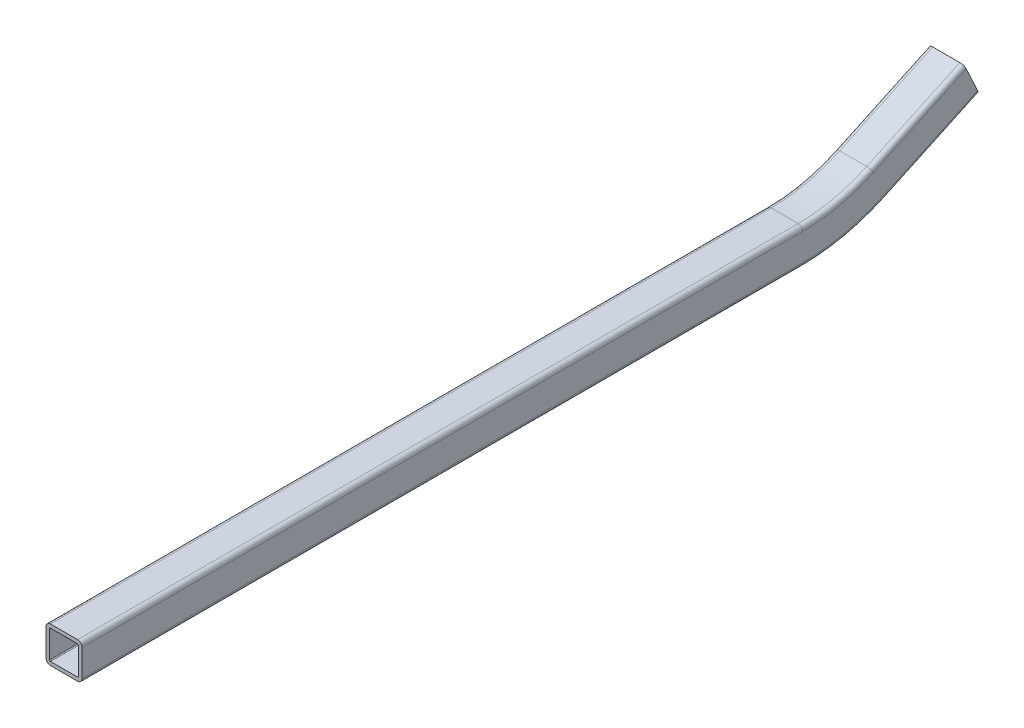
ISO-10303-21;
HEADER;
FILE_DESCRIPTION(('STEP AP214'),'2;1');
FILE_NAME('part.step','',(''),(''),'','','');
FILE_SCHEMA(('AUTOMOTIVE_DESIGN { 1 0 10303 214 1 1 1 1 }'));
ENDSEC;
DATA;
#1=APPLICATION_CONTEXT('core data for automotive mechanical design processes');
#2=APPLICATION_PROTOCOL_DEFINITION('international standard','automotive_design',2000,#1);
#3=PRODUCT_CONTEXT('',#1,'mechanical');
#4=PRODUCT('Part','Part','',(#3));
#5=PRODUCT_RELATED_PRODUCT_CATEGORY('part','',(#4));
#6=PRODUCT_DEFINITION_FORMATION('','',#4);
#7=PRODUCT_DEFINITION_CONTEXT('part definition',#1,'design');
#8=PRODUCT_DEFINITION('design','',#6,#7);
#9=PRODUCT_DEFINITION_SHAPE('','',#8);
#10=(LENGTH_UNIT() NAMED_UNIT(*) SI_UNIT(.MILLI.,.METRE.));
#11=(NAMED_UNIT(*) PLANE_ANGLE_UNIT() SI_UNIT($,.RADIAN.));
#12=(NAMED_UNIT(*) SI_UNIT($,.STERADIAN.) SOLID_ANGLE_UNIT());
#13=UNCERTAINTY_MEASURE_WITH_UNIT(LENGTH_MEASURE(1.E-05),#10,'distance_accuracy_value','');
#14=(GEOMETRIC_REPRESENTATION_CONTEXT(3) GLOBAL_UNCERTAINTY_ASSIGNED_CONTEXT((#13)) GLOBAL_UNIT_ASSIGNED_CONTEXT((#10,
#11,#12)) REPRESENTATION_CONTEXT('',''));
#15=CARTESIAN_POINT('',(0.,0.,0.));
#16=DIRECTION('',(0.,0.,1.));
#17=DIRECTION('',(1.,0.,0.));
#18=AXIS2_PLACEMENT_3D('',#15,#16,#17);
#19=CARTESIAN_POINT('',(-7.5,16.1665296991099,-439.092189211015));
#20=DIRECTION('',(0.,0.4226182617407,-0.90630778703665));
#21=DIRECTION('',(0.,0.90630778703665,0.4226182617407));
#22=AXIS2_PLACEMENT_3D('',#19,#20,#21);
#23=CYLINDRICAL_SURFACE('',#22,2.5);
#24=CARTESIAN_POINT('',(-7.5,16.1665296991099,-439.092189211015));
#25=DIRECTION('',(0.,-0.4226182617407,0.906307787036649));
#26=DIRECTION('',(1.,0.,0.));
#27=AXIS2_PLACEMENT_3D('',#24,#25,#26);
#28=CIRCLE('',#27,2.5);
#29=CARTESIAN_POINT('',(-7.5,18.4322991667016,-438.035643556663));
#30=VERTEX_POINT('',#29);
#31=CARTESIAN_POINT('',(-10.,16.1665296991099,-439.092189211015));
#32=VERTEX_POINT('',#31);
#33=EDGE_CURVE('E412',#30,#32,#28,.T.);
#34=ORIENTED_EDGE('',*,*,#33,.F.);
#35=DIRECTION('',(0.,0.4226182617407,-0.90630778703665));
#36=VECTOR('',#35,1.);
#37=CARTESIAN_POINT('',(-7.5,18.4322991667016,-438.035643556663));
#38=LINE('',#37,#36);
#39=CARTESIAN_POINT('',(-7.5,42.5215400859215,-489.695187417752));
#40=VERTEX_POINT('',#39);
#41=EDGE_CURVE('E533',#30,#40,#38,.T.);
#42=ORIENTED_EDGE('',*,*,#41,.T.);
#43=CARTESIAN_POINT('',(-7.5,40.2557706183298,-490.751733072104));
#44=DIRECTION('',(0.,-0.4226182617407,0.906307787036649));
#45=DIRECTION('',(1.,0.,0.));
#46=AXIS2_PLACEMENT_3D('',#43,#44,#45);
#47=CIRCLE('',#46,2.5);
#48=CARTESIAN_POINT('',(-10.,40.2557706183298,-490.751733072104));
#49=VERTEX_POINT('',#48);
#50=EDGE_CURVE('E54',#40,#49,#47,.T.);
#51=ORIENTED_EDGE('',*,*,#50,.T.);
#52=DIRECTION('',(0.,0.4226182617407,-0.90630778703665));
#53=VECTOR('',#52,1.);
#54=CARTESIAN_POINT('',(-10.,16.1665296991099,-439.092189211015));
#55=LINE('',#54,#53);
#56=EDGE_CURVE('E39',#32,#49,#55,.T.);
#57=ORIENTED_EDGE('',*,*,#56,.F.);
#58=EDGE_LOOP('',(#34,#42,#51,#57));
#59=FACE_BOUND('',#58,.T.);
#60=ADVANCED_FACE('F32',(#59),#23,.T.);
#61=CARTESIAN_POINT('',(-7.5,18.4322991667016,-438.035643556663));
#62=DIRECTION('',(0.,-0.90630778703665,-0.4226182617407));
#63=DIRECTION('',(0.,0.4226182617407,-0.90630778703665));
#64=AXIS2_PLACEMENT_3D('',#61,#62,#63);
#65=PLANE('',#64);
#66=DIRECTION('',(-1.,0.,0.));
#67=VECTOR('',#66,1.);
#68=CARTESIAN_POINT('',(-7.5,18.4322991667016,-438.035643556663));
#69=LINE('',#68,#67);
#70=CARTESIAN_POINT('',(7.5,18.4322991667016,-438.035643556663));
#71=VERTEX_POINT('',#70);
#72=EDGE_CURVE('E409',#71,#30,#69,.T.);
#73=ORIENTED_EDGE('',*,*,#72,.F.);
#74=DIRECTION('',(0.,0.4226182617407,-0.90630778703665));
#75=VECTOR('',#74,1.);
#76=CARTESIAN_POINT('',(7.5,18.4322991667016,-438.035643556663));
#77=LINE('',#76,#75);
#78=CARTESIAN_POINT('',(7.5,42.5215400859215,-489.695187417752));
#79=VERTEX_POINT('',#78);
#80=EDGE_CURVE('E530',#71,#79,#77,.T.);
#81=ORIENTED_EDGE('',*,*,#80,.T.);
#82=DIRECTION('',(-1.,0.,0.));
#83=VECTOR('',#82,1.);
#84=CARTESIAN_POINT('',(-7.5,42.5215400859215,-489.695187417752));
#85=LINE('',#84,#83);
#86=EDGE_CURVE('E492',#79,#40,#85,.T.);
#87=ORIENTED_EDGE('',*,*,#86,.T.);
#88=ORIENTED_EDGE('',*,*,#41,.F.);
#89=EDGE_LOOP('',(#73,#81,#87,#88));
#90=FACE_BOUND('',#89,.T.);
#91=ADVANCED_FACE('F548',(#90),#65,.F.);
#92=CARTESIAN_POINT('',(7.5,16.1665296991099,-439.092189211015));
#93=DIRECTION('',(0.,0.4226182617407,-0.90630778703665));
#94=DIRECTION('',(0.,0.90630778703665,0.4226182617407));
#95=AXIS2_PLACEMENT_3D('',#92,#93,#94);
#96=CYLINDRICAL_SURFACE('',#95,2.5);
#97=CARTESIAN_POINT('',(7.5,16.1665296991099,-439.092189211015));
#98=DIRECTION('',(0.,-0.4226182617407,0.906307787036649));
#99=DIRECTION('',(-1.,0.,0.));
#100=AXIS2_PLACEMENT_3D('',#97,#98,#99);
#101=CIRCLE('',#100,2.5);
#102=CARTESIAN_POINT('',(10.,16.1665296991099,-439.092189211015));
#103=VERTEX_POINT('',#102);
#104=EDGE_CURVE('E406',#103,#71,#101,.T.);
#105=ORIENTED_EDGE('',*,*,#104,.F.);
#106=DIRECTION('',(0.,0.4226182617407,-0.90630778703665));
#107=VECTOR('',#106,1.);
#108=CARTESIAN_POINT('',(10.,16.1665296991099,-439.092189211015));
#109=LINE('',#108,#107);
#110=CARTESIAN_POINT('',(10.,40.2557706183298,-490.751733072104));
#111=VERTEX_POINT('',#110);
#112=EDGE_CURVE('E527',#103,#111,#109,.T.);
#113=ORIENTED_EDGE('',*,*,#112,.T.);
#114=CARTESIAN_POINT('',(7.5,40.2557706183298,-490.751733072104));
#115=DIRECTION('',(0.,-0.4226182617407,0.906307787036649));
#116=DIRECTION('',(-1.,0.,0.));
#117=AXIS2_PLACEMENT_3D('',#114,#115,#116);
#118=CIRCLE('',#117,2.5);
#119=EDGE_CURVE('E490',#111,#79,#118,.T.);
#120=ORIENTED_EDGE('',*,*,#119,.T.);
#121=ORIENTED_EDGE('',*,*,#80,.F.);
#122=EDGE_LOOP('',(#105,#113,#120,#121));
#123=FACE_BOUND('',#122,.T.);
#124=ADVANCED_FACE('F554',(#123),#96,.T.);
#125=CARTESIAN_POINT('',(7.5,2.57191289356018,-445.431463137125));
#126=DIRECTION('',(0.,0.4226182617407,-0.90630778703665));
#127=DIRECTION('',(0.,0.90630778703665,0.4226182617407));
#128=AXIS2_PLACEMENT_3D('',#125,#126,#127);
#129=CYLINDRICAL_SURFACE('',#128,2.5);
#130=CARTESIAN_POINT('',(7.5,2.57191289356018,-445.431463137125));
#131=DIRECTION('',(0.,-0.4226182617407,0.906307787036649));
#132=DIRECTION('',(1.,0.,0.));
#133=AXIS2_PLACEMENT_3D('',#130,#131,#132);
#134=CIRCLE('',#133,2.5);
#135=CARTESIAN_POINT('',(7.5,0.306143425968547,-446.488008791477));
#136=VERTEX_POINT('',#135);
#137=CARTESIAN_POINT('',(10.,2.57191289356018,-445.431463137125));
#138=VERTEX_POINT('',#137);
#139=EDGE_CURVE('E403',#136,#138,#134,.T.);
#140=ORIENTED_EDGE('',*,*,#139,.F.);
#141=DIRECTION('',(0.,0.4226182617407,-0.90630778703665));
#142=VECTOR('',#141,1.);
#143=CARTESIAN_POINT('',(7.5,0.306143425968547,-446.488008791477));
#144=LINE('',#143,#142);
#145=CARTESIAN_POINT('',(7.5,24.3953843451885,-498.147552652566));
#146=VERTEX_POINT('',#145);
#147=EDGE_CURVE('E521',#136,#146,#144,.T.);
#148=ORIENTED_EDGE('',*,*,#147,.T.);
#149=CARTESIAN_POINT('',(7.5,26.6611538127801,-497.091006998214));
#150=DIRECTION('',(0.,-0.4226182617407,0.906307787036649));
#151=DIRECTION('',(1.,0.,0.));
#152=AXIS2_PLACEMENT_3D('',#149,#150,#151);
#153=CIRCLE('',#152,2.5);
#154=CARTESIAN_POINT('',(10.,26.6611538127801,-497.091006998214));
#155=VERTEX_POINT('',#154);
#156=EDGE_CURVE('E486',#146,#155,#153,.T.);
#157=ORIENTED_EDGE('',*,*,#156,.T.);
#158=DIRECTION('',(0.,0.4226182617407,-0.90630778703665));
#159=VECTOR('',#158,1.);
#160=CARTESIAN_POINT('',(10.,2.57191289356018,-445.431463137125));
#161=LINE('',#160,#159);
#162=EDGE_CURVE('E524',#138,#155,#161,.T.);
#163=ORIENTED_EDGE('',*,*,#162,.F.);
#164=EDGE_LOOP('',(#140,#148,#157,#163));
#165=FACE_BOUND('',#164,.T.);
#166=ADVANCED_FACE('F593',(#165),#129,.T.);
#167=CARTESIAN_POINT('',(-7.5,0.306143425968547,-446.488008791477));
#168=DIRECTION('',(0.,0.90630778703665,0.4226182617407));
#169=DIRECTION('',(0.,-0.4226182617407,0.90630778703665));
#170=AXIS2_PLACEMENT_3D('',#167,#168,#169);
#171=PLANE('',#170);
#172=DIRECTION('',(1.,0.,0.));
#173=VECTOR('',#172,1.);
#174=CARTESIAN_POINT('',(-7.5,0.306143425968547,-446.488008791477));
#175=LINE('',#174,#173);
#176=CARTESIAN_POINT('',(-7.5,0.306143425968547,-446.488008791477));
#177=VERTEX_POINT('',#176);
#178=EDGE_CURVE('E399',#177,#136,#175,.T.);
#179=ORIENTED_EDGE('',*,*,#178,.F.);
#180=DIRECTION('',(0.,0.4226182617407,-0.90630778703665));
#181=VECTOR('',#180,1.);
#182=CARTESIAN_POINT('',(-7.5,0.306143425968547,-446.488008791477));
#183=LINE('',#182,#181);
#184=CARTESIAN_POINT('',(-7.5,24.3953843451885,-498.147552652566));
#185=VERTEX_POINT('',#184);
#186=EDGE_CURVE('E496',#177,#185,#183,.T.);
#187=ORIENTED_EDGE('',*,*,#186,.T.);
#188=DIRECTION('',(1.,0.,0.));
#189=VECTOR('',#188,1.);
#190=CARTESIAN_POINT('',(-7.5,24.3953843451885,-498.147552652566));
#191=LINE('',#190,#189);
#192=EDGE_CURVE('E483',#185,#146,#191,.T.);
#193=ORIENTED_EDGE('',*,*,#192,.T.);
#194=ORIENTED_EDGE('',*,*,#147,.F.);
#195=EDGE_LOOP('',(#179,#187,#193,#194));
#196=FACE_BOUND('',#195,.T.);
#197=ADVANCED_FACE('F596',(#196),#171,.F.);
#198=CARTESIAN_POINT('',(-7.5,2.57191289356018,-445.431463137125));
#199=DIRECTION('',(0.,0.4226182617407,-0.90630778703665));
#200=DIRECTION('',(0.,0.90630778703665,0.4226182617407));
#201=AXIS2_PLACEMENT_3D('',#198,#199,#200);
#202=CYLINDRICAL_SURFACE('',#201,2.5);
#203=CARTESIAN_POINT('',(-7.5,2.57191289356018,-445.431463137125));
#204=DIRECTION('',(0.,-0.4226182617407,0.906307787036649));
#205=DIRECTION('',(1.,0.,0.));
#206=AXIS2_PLACEMENT_3D('',#203,#204,#205);
#207=CIRCLE('',#206,2.5);
#208=CARTESIAN_POINT('',(-10.,2.57191289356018,-445.431463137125));
#209=VERTEX_POINT('',#208);
#210=EDGE_CURVE('E396',#209,#177,#207,.T.);
#211=ORIENTED_EDGE('',*,*,#210,.F.);
#212=DIRECTION('',(0.,0.4226182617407,-0.90630778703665));
#213=VECTOR('',#212,1.);
#214=CARTESIAN_POINT('',(-10.,2.57191289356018,-445.431463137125));
#215=LINE('',#214,#213);
#216=CARTESIAN_POINT('',(-10.,26.6611538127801,-497.091006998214));
#217=VERTEX_POINT('',#216);
#218=EDGE_CURVE('E11',#209,#217,#215,.T.);
#219=ORIENTED_EDGE('',*,*,#218,.T.);
#220=CARTESIAN_POINT('',(-7.5,26.6611538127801,-497.091006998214));
#221=DIRECTION('',(0.,-0.4226182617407,0.906307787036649));
#222=DIRECTION('',(1.,0.,0.));
#223=AXIS2_PLACEMENT_3D('',#220,#221,#222);
#224=CIRCLE('',#223,2.5);
#225=EDGE_CURVE('E481',#217,#185,#224,.T.);
#226=ORIENTED_EDGE('',*,*,#225,.T.);
#227=ORIENTED_EDGE('',*,*,#186,.F.);
#228=EDGE_LOOP('',(#211,#219,#226,#227));
#229=FACE_BOUND('',#228,.T.);
#230=ADVANCED_FACE('F564',(#229),#202,.T.);
#231=CARTESIAN_POINT('',(-7.5,2.57191289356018,-445.431463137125));
#232=DIRECTION('',(0.,0.4226182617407,-0.90630778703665));
#233=DIRECTION('',(0.,0.90630778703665,0.4226182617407));
#234=AXIS2_PLACEMENT_3D('',#231,#232,#233);
#235=CYLINDRICAL_SURFACE('',#234,0.5);
#236=CARTESIAN_POINT('',(-7.5,2.57191289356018,-445.431463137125));
#237=DIRECTION('',(0.,-0.4226182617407,0.906307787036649));
#238=DIRECTION('',(1.,0.,0.));
#239=AXIS2_PLACEMENT_3D('',#236,#237,#238);
#240=CIRCLE('',#239,0.5);
#241=CARTESIAN_POINT('',(-8.,2.57191289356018,-445.431463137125));
#242=VERTEX_POINT('',#241);
#243=CARTESIAN_POINT('',(-7.5,2.11875900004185,-445.642772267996));
#244=VERTEX_POINT('',#243);
#245=EDGE_CURVE('E254',#242,#244,#240,.T.);
#246=ORIENTED_EDGE('',*,*,#245,.T.);
#247=DIRECTION('',(0.,0.4226182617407,-0.90630778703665));
#248=VECTOR('',#247,1.);
#249=CARTESIAN_POINT('',(-7.5,2.11875900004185,-445.642772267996));
#250=LINE('',#249,#248);
#251=CARTESIAN_POINT('',(-7.5,26.2079999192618,-497.302316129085));
#252=VERTEX_POINT('',#251);
#253=EDGE_CURVE('E511',#244,#252,#250,.T.);
#254=ORIENTED_EDGE('',*,*,#253,.T.);
#255=CARTESIAN_POINT('',(-7.5,26.6611538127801,-497.091006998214));
#256=DIRECTION('',(0.,-0.4226182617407,0.906307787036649));
#257=DIRECTION('',(1.,0.,0.));
#258=AXIS2_PLACEMENT_3D('',#255,#256,#257);
#259=CIRCLE('',#258,0.5);
#260=CARTESIAN_POINT('',(-8.,26.6611538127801,-497.091006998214));
#261=VERTEX_POINT('',#260);
#262=EDGE_CURVE('E474',#261,#252,#259,.T.);
#263=ORIENTED_EDGE('',*,*,#262,.F.);
#264=DIRECTION('',(0.,0.4226182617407,-0.90630778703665));
#265=VECTOR('',#264,1.);
#266=CARTESIAN_POINT('',(-8.,2.57191289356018,-445.431463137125));
#267=LINE('',#266,#265);
#268=EDGE_CURVE('E514',#242,#261,#267,.T.);
#269=ORIENTED_EDGE('',*,*,#268,.F.);
#270=EDGE_LOOP('',(#246,#254,#263,#269));
#271=FACE_BOUND('',#270,.T.);
#272=ADVANCED_FACE('F631',(#271),#235,.F.);
#273=CARTESIAN_POINT('',(-7.5,2.11875900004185,-445.642772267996));
#274=DIRECTION('',(0.,0.90630778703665,0.4226182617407));
#275=DIRECTION('',(0.,-0.4226182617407,0.90630778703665));
#276=AXIS2_PLACEMENT_3D('',#273,#274,#275);
#277=PLANE('',#276);
#278=DIRECTION('',(1.,0.,0.));
#279=VECTOR('',#278,1.);
#280=CARTESIAN_POINT('',(-7.5,2.11875900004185,-445.642772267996));
#281=LINE('',#280,#279);
#282=CARTESIAN_POINT('',(7.5,2.11875900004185,-445.642772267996));
#283=VERTEX_POINT('',#282);
#284=EDGE_CURVE('E391',#244,#283,#281,.T.);
#285=ORIENTED_EDGE('',*,*,#284,.T.);
#286=DIRECTION('',(0.,0.4226182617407,-0.90630778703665));
#287=VECTOR('',#286,1.);
#288=CARTESIAN_POINT('',(7.5,2.11875900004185,-445.642772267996));
#289=LINE('',#288,#287);
#290=CARTESIAN_POINT('',(7.5,26.2079999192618,-497.302316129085));
#291=VERTEX_POINT('',#290);
#292=EDGE_CURVE('E508',#283,#291,#289,.T.);
#293=ORIENTED_EDGE('',*,*,#292,.T.);
#294=DIRECTION('',(1.,0.,0.));
#295=VECTOR('',#294,1.);
#296=CARTESIAN_POINT('',(-7.5,26.2079999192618,-497.302316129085));
#297=LINE('',#296,#295);
#298=EDGE_CURVE('E471',#252,#291,#297,.T.);
#299=ORIENTED_EDGE('',*,*,#298,.F.);
#300=ORIENTED_EDGE('',*,*,#253,.F.);
#301=EDGE_LOOP('',(#285,#293,#299,#300));
#302=FACE_BOUND('',#301,.T.);
#303=ADVANCED_FACE('F634',(#302),#277,.T.);
#304=CARTESIAN_POINT('',(7.5,2.57191289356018,-445.431463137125));
#305=DIRECTION('',(0.,0.4226182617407,-0.90630778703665));
#306=DIRECTION('',(0.,0.90630778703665,0.4226182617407));
#307=AXIS2_PLACEMENT_3D('',#304,#305,#306);
#308=CYLINDRICAL_SURFACE('',#307,0.500000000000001);
#309=CARTESIAN_POINT('',(7.5,2.57191289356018,-445.431463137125));
#310=DIRECTION('',(0.,-0.4226182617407,0.906307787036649));
#311=DIRECTION('',(1.,0.,0.));
#312=AXIS2_PLACEMENT_3D('',#309,#310,#311);
#313=CIRCLE('',#312,0.500000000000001);
#314=CARTESIAN_POINT('',(8.,2.57191289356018,-445.431463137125));
#315=VERTEX_POINT('',#314);
#316=EDGE_CURVE('E388',#283,#315,#313,.T.);
#317=ORIENTED_EDGE('',*,*,#316,.T.);
#318=DIRECTION('',(0.,0.4226182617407,-0.90630778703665));
#319=VECTOR('',#318,1.);
#320=CARTESIAN_POINT('',(8.,2.57191289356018,-445.431463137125));
#321=LINE('',#320,#319);
#322=CARTESIAN_POINT('',(8.,26.6611538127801,-497.091006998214));
#323=VERTEX_POINT('',#322);
#324=EDGE_CURVE('E505',#315,#323,#321,.T.);
#325=ORIENTED_EDGE('',*,*,#324,.T.);
#326=CARTESIAN_POINT('',(7.5,26.6611538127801,-497.091006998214));
#327=DIRECTION('',(0.,-0.4226182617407,0.906307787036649));
#328=DIRECTION('',(1.,0.,0.));
#329=AXIS2_PLACEMENT_3D('',#326,#327,#328);
#330=CIRCLE('',#329,0.500000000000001);
#331=EDGE_CURVE('E468',#291,#323,#330,.T.);
#332=ORIENTED_EDGE('',*,*,#331,.F.);
#333=ORIENTED_EDGE('',*,*,#292,.F.);
#334=EDGE_LOOP('',(#317,#325,#332,#333));
#335=FACE_BOUND('',#334,.T.);
#336=ADVANCED_FACE('F638',(#335),#308,.F.);
#337=CARTESIAN_POINT('',(7.5,16.1665296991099,-439.092189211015));
#338=DIRECTION('',(0.,0.4226182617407,-0.90630778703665));
#339=DIRECTION('',(0.,0.90630778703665,0.4226182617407));
#340=AXIS2_PLACEMENT_3D('',#337,#338,#339);
#341=CYLINDRICAL_SURFACE('',#340,0.5);
#342=CARTESIAN_POINT('',(7.5,16.1665296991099,-439.092189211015));
#343=DIRECTION('',(0.,-0.4226182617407,0.906307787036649));
#344=DIRECTION('',(-1.,0.,0.));
#345=AXIS2_PLACEMENT_3D('',#342,#343,#344);
#346=CIRCLE('',#345,0.5);
#347=CARTESIAN_POINT('',(8.,16.1665296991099,-439.092189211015));
#348=VERTEX_POINT('',#347);
#349=CARTESIAN_POINT('',(7.5,16.6196835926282,-438.880880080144));
#350=VERTEX_POINT('',#349);
#351=EDGE_CURVE('E385',#348,#350,#346,.T.);
#352=ORIENTED_EDGE('',*,*,#351,.T.);
#353=DIRECTION('',(0.,0.4226182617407,-0.90630778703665));
#354=VECTOR('',#353,1.);
#355=CARTESIAN_POINT('',(7.5,16.6196835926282,-438.880880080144));
#356=LINE('',#355,#354);
#357=CARTESIAN_POINT('',(7.5,40.7089245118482,-490.540423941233));
#358=VERTEX_POINT('',#357);
#359=EDGE_CURVE('E499',#350,#358,#356,.T.);
#360=ORIENTED_EDGE('',*,*,#359,.T.);
#361=CARTESIAN_POINT('',(7.5,40.2557706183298,-490.751733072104));
#362=DIRECTION('',(0.,-0.4226182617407,0.906307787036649));
#363=DIRECTION('',(-1.,0.,0.));
#364=AXIS2_PLACEMENT_3D('',#361,#362,#363);
#365=CIRCLE('',#364,0.5);
#366=CARTESIAN_POINT('',(8.,40.2557706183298,-490.751733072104));
#367=VERTEX_POINT('',#366);
#368=EDGE_CURVE('E462',#367,#358,#365,.T.);
#369=ORIENTED_EDGE('',*,*,#368,.F.);
#370=DIRECTION('',(0.,0.4226182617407,-0.90630778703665));
#371=VECTOR('',#370,1.);
#372=CARTESIAN_POINT('',(8.,16.1665296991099,-439.092189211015));
#373=LINE('',#372,#371);
#374=EDGE_CURVE('E502',#348,#367,#373,.T.);
#375=ORIENTED_EDGE('',*,*,#374,.F.);
#376=EDGE_LOOP('',(#352,#360,#369,#375));
#377=FACE_BOUND('',#376,.T.);
#378=ADVANCED_FACE('F642',(#377),#341,.F.);
#379=CARTESIAN_POINT('',(-7.5,16.6196835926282,-438.880880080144));
#380=DIRECTION('',(0.,-0.90630778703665,-0.4226182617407));
#381=DIRECTION('',(0.,0.4226182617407,-0.90630778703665));
#382=AXIS2_PLACEMENT_3D('',#379,#380,#381);
#383=PLANE('',#382);
#384=DIRECTION('',(-1.,0.,0.));
#385=VECTOR('',#384,1.);
#386=CARTESIAN_POINT('',(-7.5,16.6196835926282,-438.880880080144));
#387=LINE('',#386,#385);
#388=CARTESIAN_POINT('',(-7.5,16.6196835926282,-438.880880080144));
#389=VERTEX_POINT('',#388);
#390=EDGE_CURVE('E382',#350,#389,#387,.T.);
#391=ORIENTED_EDGE('',*,*,#390,.T.);
#392=DIRECTION('',(0.,0.4226182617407,-0.90630778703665));
#393=VECTOR('',#392,1.);
#394=CARTESIAN_POINT('',(-7.5,16.6196835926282,-438.880880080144));
#395=LINE('',#394,#393);
#396=CARTESIAN_POINT('',(-7.5,40.7089245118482,-490.540423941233));
#397=VERTEX_POINT('',#396);
#398=EDGE_CURVE('E480',#389,#397,#395,.T.);
#399=ORIENTED_EDGE('',*,*,#398,.T.);
#400=DIRECTION('',(-1.,0.,0.));
#401=VECTOR('',#400,1.);
#402=CARTESIAN_POINT('',(-7.5,40.7089245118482,-490.540423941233));
#403=LINE('',#402,#401);
#404=EDGE_CURVE('E459',#358,#397,#403,.T.);
#405=ORIENTED_EDGE('',*,*,#404,.F.);
#406=ORIENTED_EDGE('',*,*,#359,.F.);
#407=EDGE_LOOP('',(#391,#399,#405,#406));
#408=FACE_BOUND('',#407,.T.);
#409=ADVANCED_FACE('F646',(#408),#383,.T.);
#410=CARTESIAN_POINT('',(-7.5,16.1665296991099,-439.092189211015));
#411=DIRECTION('',(0.,0.4226182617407,-0.90630778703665));
#412=DIRECTION('',(0.,0.90630778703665,0.4226182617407));
#413=AXIS2_PLACEMENT_3D('',#410,#411,#412);
#414=CYLINDRICAL_SURFACE('',#413,0.5);
#415=CARTESIAN_POINT('',(-7.5,16.1665296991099,-439.092189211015));
#416=DIRECTION('',(0.,-0.4226182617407,0.906307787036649));
#417=DIRECTION('',(1.,0.,0.));
#418=AXIS2_PLACEMENT_3D('',#415,#416,#417);
#419=CIRCLE('',#418,0.5);
#420=CARTESIAN_POINT('',(-8.,16.1665296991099,-439.092189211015));
#421=VERTEX_POINT('',#420);
#422=EDGE_CURVE('E250',#389,#421,#419,.T.);
#423=ORIENTED_EDGE('',*,*,#422,.T.);
#424=DIRECTION('',(0.,0.4226182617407,-0.90630778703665));
#425=VECTOR('',#424,1.);
#426=CARTESIAN_POINT('',(-8.,16.1665296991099,-439.092189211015));
#427=LINE('',#426,#425);
#428=CARTESIAN_POINT('',(-8.,40.2557706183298,-490.751733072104));
#429=VERTEX_POINT('',#428);
#430=EDGE_CURVE('E484',#421,#429,#427,.T.);
#431=ORIENTED_EDGE('',*,*,#430,.T.);
#432=CARTESIAN_POINT('',(-7.5,40.2557706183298,-490.751733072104));
#433=DIRECTION('',(0.,-0.4226182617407,0.906307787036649));
#434=DIRECTION('',(1.,0.,0.));
#435=AXIS2_PLACEMENT_3D('',#432,#433,#434);
#436=CIRCLE('',#435,0.5);
#437=EDGE_CURVE('E456',#397,#429,#436,.T.);
#438=ORIENTED_EDGE('',*,*,#437,.F.);
#439=ORIENTED_EDGE('',*,*,#398,.F.);
#440=EDGE_LOOP('',(#423,#431,#438,#439));
#441=FACE_BOUND('',#440,.T.);
#442=ADVANCED_FACE('F650',(#441),#414,.F.);
#443=CARTESIAN_POINT('',(-7.5,100.,-400.));
#444=DIRECTION('',(1.,0.,0.));
#445=DIRECTION('',(0.,0.,-1.));
#446=AXIS2_PLACEMENT_3D('',#443,#444,#445);
#447=TOROIDAL_SURFACE('',#446,92.5,2.5);
#448=CARTESIAN_POINT('',(-7.5,7.5,-400.));
#449=DIRECTION('',(0.,0.,1.));
#450=DIRECTION('',(1.,0.,0.));
#451=AXIS2_PLACEMENT_3D('',#448,#449,#450);
#452=CIRCLE('',#451,2.5);
#453=CARTESIAN_POINT('',(-7.5,10.,-400.));
#454=VERTEX_POINT('',#453);
#455=CARTESIAN_POINT('',(-10.,7.5,-400.));
#456=VERTEX_POINT('',#455);
#457=EDGE_CURVE('E275',#454,#456,#452,.T.);
#458=ORIENTED_EDGE('',*,*,#457,.F.);
#459=CARTESIAN_POINT('',(-7.5,100.,-400.));
#460=DIRECTION('',(1.,0.,0.));
#461=DIRECTION('',(0.,0.,-1.));
#462=AXIS2_PLACEMENT_3D('',#459,#460,#461);
#463=CIRCLE('',#462,90.);
#464=EDGE_CURVE('E447',#454,#30,#463,.T.);
#465=ORIENTED_EDGE('',*,*,#464,.T.);
#466=ORIENTED_EDGE('',*,*,#33,.T.);
#467=CARTESIAN_POINT('',(-10.,100.,-400.));
#468=DIRECTION('',(1.,0.,0.));
#469=DIRECTION('',(0.,0.,-1.));
#470=AXIS2_PLACEMENT_3D('',#467,#468,#469);
#471=CIRCLE('',#470,92.5);
#472=EDGE_CURVE('E450',#456,#32,#471,.T.);
#473=ORIENTED_EDGE('',*,*,#472,.F.);
#474=EDGE_LOOP('',(#458,#465,#466,#473));
#475=FACE_BOUND('',#474,.T.);
#476=ADVANCED_FACE('F540',(#475),#447,.T.);
#477=CARTESIAN_POINT('',(0.,100.,-400.));
#478=DIRECTION('',(1.,0.,0.));
#479=DIRECTION('',(0.,0.,-1.));
#480=AXIS2_PLACEMENT_3D('',#477,#478,#479);
#481=CYLINDRICAL_SURFACE('',#480,90.);
#482=DIRECTION('',(-1.,0.,0.));
#483=VECTOR('',#482,1.);
#484=CARTESIAN_POINT('',(-7.5,10.,-400.));
#485=LINE('',#484,#483);
#486=CARTESIAN_POINT('',(7.5,10.,-400.));
#487=VERTEX_POINT('',#486);
#488=EDGE_CURVE('E308',#487,#454,#485,.T.);
#489=ORIENTED_EDGE('',*,*,#488,.F.);
#490=CARTESIAN_POINT('',(7.5,100.,-400.));
#491=DIRECTION('',(1.,0.,0.));
#492=DIRECTION('',(0.,0.,-1.));
#493=AXIS2_PLACEMENT_3D('',#490,#491,#492);
#494=CIRCLE('',#493,90.);
#495=EDGE_CURVE('E444',#487,#71,#494,.T.);
#496=ORIENTED_EDGE('',*,*,#495,.T.);
#497=ORIENTED_EDGE('',*,*,#72,.T.);
#498=ORIENTED_EDGE('',*,*,#464,.F.);
#499=EDGE_LOOP('',(#489,#496,#497,#498));
#500=FACE_BOUND('',#499,.T.);
#501=ADVANCED_FACE('F544',(#500),#481,.F.);
#502=CARTESIAN_POINT('',(7.5,100.,-400.));
#503=DIRECTION('',(1.,0.,0.));
#504=DIRECTION('',(0.,0.,-1.));
#505=AXIS2_PLACEMENT_3D('',#502,#503,#504);
#506=TOROIDAL_SURFACE('',#505,92.5,2.5);
#507=CARTESIAN_POINT('',(7.5,7.5,-400.));
#508=DIRECTION('',(0.,0.,1.));
#509=DIRECTION('',(-1.,0.,0.));
#510=AXIS2_PLACEMENT_3D('',#507,#508,#509);
#511=CIRCLE('',#510,2.5);
#512=CARTESIAN_POINT('',(10.,7.5,-400.));
#513=VERTEX_POINT('',#512);
#514=EDGE_CURVE('E305',#513,#487,#511,.T.);
#515=ORIENTED_EDGE('',*,*,#514,.F.);
#516=CARTESIAN_POINT('',(10.,100.,-400.));
#517=DIRECTION('',(1.,0.,0.));
#518=DIRECTION('',(0.,0.,-1.));
#519=AXIS2_PLACEMENT_3D('',#516,#517,#518);
#520=CIRCLE('',#519,92.5);
#521=EDGE_CURVE('E441',#513,#103,#520,.T.);
#522=ORIENTED_EDGE('',*,*,#521,.T.);
#523=ORIENTED_EDGE('',*,*,#104,.T.);
#524=ORIENTED_EDGE('',*,*,#495,.F.);
#525=EDGE_LOOP('',(#515,#522,#523,#524));
#526=FACE_BOUND('',#525,.T.);
#527=ADVANCED_FACE('F552',(#526),#506,.T.);
#528=CARTESIAN_POINT('',(7.5,100.,-400.));
#529=DIRECTION('',(1.,0.,0.));
#530=DIRECTION('',(0.,0.,-1.));
#531=AXIS2_PLACEMENT_3D('',#528,#529,#530);
#532=TOROIDAL_SURFACE('',#531,107.5,2.5);
#533=CARTESIAN_POINT('',(7.5,-7.5,-400.));
#534=DIRECTION('',(0.,0.,1.));
#535=DIRECTION('',(1.,0.,0.));
#536=AXIS2_PLACEMENT_3D('',#533,#534,#535);
#537=CIRCLE('',#536,2.5);
#538=CARTESIAN_POINT('',(7.5,-10.,-400.));
#539=VERTEX_POINT('',#538);
#540=CARTESIAN_POINT('',(10.,-7.5,-400.));
#541=VERTEX_POINT('',#540);
#542=EDGE_CURVE('E302',#539,#541,#537,.T.);
#543=ORIENTED_EDGE('',*,*,#542,.F.);
#544=CARTESIAN_POINT('',(7.5,100.,-400.));
#545=DIRECTION('',(1.,0.,0.));
#546=DIRECTION('',(0.,0.,-1.));
#547=AXIS2_PLACEMENT_3D('',#544,#545,#546);
#548=CIRCLE('',#547,110.);
#549=EDGE_CURVE('E435',#539,#136,#548,.T.);
#550=ORIENTED_EDGE('',*,*,#549,.T.);
#551=ORIENTED_EDGE('',*,*,#139,.T.);
#552=CARTESIAN_POINT('',(10.,100.,-400.));
#553=DIRECTION('',(1.,0.,0.));
#554=DIRECTION('',(0.,0.,-1.));
#555=AXIS2_PLACEMENT_3D('',#552,#553,#554);
#556=CIRCLE('',#555,107.5);
#557=EDGE_CURVE('E438',#541,#138,#556,.T.);
#558=ORIENTED_EDGE('',*,*,#557,.F.);
#559=EDGE_LOOP('',(#543,#550,#551,#558));
#560=FACE_BOUND('',#559,.T.);
#561=ADVANCED_FACE('F607',(#560),#532,.T.);
#562=CARTESIAN_POINT('',(0.,100.,-400.));
#563=DIRECTION('',(1.,0.,0.));
#564=DIRECTION('',(0.,0.,-1.));
#565=AXIS2_PLACEMENT_3D('',#562,#563,#564);
#566=CYLINDRICAL_SURFACE('',#565,110.);
#567=DIRECTION('',(1.,0.,0.));
#568=VECTOR('',#567,1.);
#569=CARTESIAN_POINT('',(-7.5,-10.,-400.));
#570=LINE('',#569,#568);
#571=CARTESIAN_POINT('',(-7.5,-10.,-400.));
#572=VERTEX_POINT('',#571);
#573=EDGE_CURVE('E299',#572,#539,#570,.T.);
#574=ORIENTED_EDGE('',*,*,#573,.F.);
#575=CARTESIAN_POINT('',(-7.5,100.,-400.));
#576=DIRECTION('',(1.,0.,0.));
#577=DIRECTION('',(0.,0.,-1.));
#578=AXIS2_PLACEMENT_3D('',#575,#576,#577);
#579=CIRCLE('',#578,110.);
#580=EDGE_CURVE('E414',#572,#177,#579,.T.);
#581=ORIENTED_EDGE('',*,*,#580,.T.);
#582=ORIENTED_EDGE('',*,*,#178,.T.);
#583=ORIENTED_EDGE('',*,*,#549,.F.);
#584=EDGE_LOOP('',(#574,#581,#582,#583));
#585=FACE_BOUND('',#584,.T.);
#586=ADVANCED_FACE('F598',(#585),#566,.T.);
#587=CARTESIAN_POINT('',(-7.5,100.,-400.));
#588=DIRECTION('',(1.,0.,0.));
#589=DIRECTION('',(0.,0.,-1.));
#590=AXIS2_PLACEMENT_3D('',#587,#588,#589);
#591=TOROIDAL_SURFACE('',#590,107.5,2.5);
#592=CARTESIAN_POINT('',(-7.5,-7.5,-400.));
#593=DIRECTION('',(0.,0.,1.));
#594=DIRECTION('',(1.,0.,0.));
#595=AXIS2_PLACEMENT_3D('',#592,#593,#594);
#596=CIRCLE('',#595,2.5);
#597=CARTESIAN_POINT('',(-10.,-7.5,-400.));
#598=VERTEX_POINT('',#597);
#599=EDGE_CURVE('E296',#598,#572,#596,.T.);
#600=ORIENTED_EDGE('',*,*,#599,.F.);
#601=CARTESIAN_POINT('',(-10.,100.,-400.));
#602=DIRECTION('',(1.,0.,0.));
#603=DIRECTION('',(0.,0.,-1.));
#604=AXIS2_PLACEMENT_3D('',#601,#602,#603);
#605=CIRCLE('',#604,107.5);
#606=EDGE_CURVE('E453',#598,#209,#605,.T.);
#607=ORIENTED_EDGE('',*,*,#606,.T.);
#608=ORIENTED_EDGE('',*,*,#210,.T.);
#609=ORIENTED_EDGE('',*,*,#580,.F.);
#610=EDGE_LOOP('',(#600,#607,#608,#609));
#611=FACE_BOUND('',#610,.T.);
#612=ADVANCED_FACE('F569',(#611),#591,.T.);
#613=CARTESIAN_POINT('',(-7.5,100.,-400.));
#614=DIRECTION('',(1.,0.,0.));
#615=DIRECTION('',(0.,0.,-1.));
#616=AXIS2_PLACEMENT_3D('',#613,#614,#615);
#617=TOROIDAL_SURFACE('',#616,107.5,0.5);
#618=CARTESIAN_POINT('',(-7.5,-7.5,-400.));
#619=DIRECTION('',(0.,0.,1.));
#620=DIRECTION('',(1.,0.,0.));
#621=AXIS2_PLACEMENT_3D('',#618,#619,#620);
#622=CIRCLE('',#621,0.5);
#623=CARTESIAN_POINT('',(-8.,-7.5,-400.));
#624=VERTEX_POINT('',#623);
#625=CARTESIAN_POINT('',(-7.5,-8.,-400.));
#626=VERTEX_POINT('',#625);
#627=EDGE_CURVE('E293',#624,#626,#622,.T.);
#628=ORIENTED_EDGE('',*,*,#627,.T.);
#629=CARTESIAN_POINT('',(-7.5,100.,-400.));
#630=DIRECTION('',(1.,0.,0.));
#631=DIRECTION('',(0.,0.,-1.));
#632=AXIS2_PLACEMENT_3D('',#629,#630,#631);
#633=CIRCLE('',#632,108.);
#634=EDGE_CURVE('E426',#626,#244,#633,.T.);
#635=ORIENTED_EDGE('',*,*,#634,.T.);
#636=ORIENTED_EDGE('',*,*,#245,.F.);
#637=CARTESIAN_POINT('',(-8.,100.,-400.));
#638=DIRECTION('',(1.,0.,0.));
#639=DIRECTION('',(0.,0.,-1.));
#640=AXIS2_PLACEMENT_3D('',#637,#638,#639);
#641=CIRCLE('',#640,107.5);
#642=EDGE_CURVE('E429',#624,#242,#641,.T.);
#643=ORIENTED_EDGE('',*,*,#642,.F.);
#644=EDGE_LOOP('',(#628,#635,#636,#643));
#645=FACE_BOUND('',#644,.T.);
#646=ADVANCED_FACE('F685',(#645),#617,.F.);
#647=CARTESIAN_POINT('',(0.,100.,-400.));
#648=DIRECTION('',(1.,0.,0.));
#649=DIRECTION('',(0.,0.,-1.));
#650=AXIS2_PLACEMENT_3D('',#647,#648,#649);
#651=CYLINDRICAL_SURFACE('',#650,108.);
#652=DIRECTION('',(1.,0.,0.));
#653=VECTOR('',#652,1.);
#654=CARTESIAN_POINT('',(-7.5,-8.,-400.));
#655=LINE('',#654,#653);
#656=CARTESIAN_POINT('',(7.5,-8.,-400.));
#657=VERTEX_POINT('',#656);
#658=EDGE_CURVE('E290',#626,#657,#655,.T.);
#659=ORIENTED_EDGE('',*,*,#658,.T.);
#660=CARTESIAN_POINT('',(7.5,100.,-400.));
#661=DIRECTION('',(1.,0.,0.));
#662=DIRECTION('',(0.,0.,-1.));
#663=AXIS2_PLACEMENT_3D('',#660,#661,#662);
#664=CIRCLE('',#663,108.);
#665=EDGE_CURVE('E423',#657,#283,#664,.T.);
#666=ORIENTED_EDGE('',*,*,#665,.T.);
#667=ORIENTED_EDGE('',*,*,#284,.F.);
#668=ORIENTED_EDGE('',*,*,#634,.F.);
#669=EDGE_LOOP('',(#659,#666,#667,#668));
#670=FACE_BOUND('',#669,.T.);
#671=ADVANCED_FACE('F694',(#670),#651,.F.);
#672=CARTESIAN_POINT('',(7.5,100.,-400.));
#673=DIRECTION('',(1.,0.,0.));
#674=DIRECTION('',(0.,0.,-1.));
#675=AXIS2_PLACEMENT_3D('',#672,#673,#674);
#676=TOROIDAL_SURFACE('',#675,107.5,0.500000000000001);
#677=CARTESIAN_POINT('',(7.5,-7.5,-400.));
#678=DIRECTION('',(0.,0.,1.));
#679=DIRECTION('',(1.,0.,0.));
#680=AXIS2_PLACEMENT_3D('',#677,#678,#679);
#681=CIRCLE('',#680,0.500000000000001);
#682=CARTESIAN_POINT('',(8.,-7.5,-400.));
#683=VERTEX_POINT('',#682);
#684=EDGE_CURVE('E287',#657,#683,#681,.T.);
#685=ORIENTED_EDGE('',*,*,#684,.T.);
#686=CARTESIAN_POINT('',(8.,100.,-400.));
#687=DIRECTION('',(1.,0.,0.));
#688=DIRECTION('',(0.,0.,-1.));
#689=AXIS2_PLACEMENT_3D('',#686,#687,#688);
#690=CIRCLE('',#689,107.5);
#691=EDGE_CURVE('E420',#683,#315,#690,.T.);
#692=ORIENTED_EDGE('',*,*,#691,.T.);
#693=ORIENTED_EDGE('',*,*,#316,.F.);
#694=ORIENTED_EDGE('',*,*,#665,.F.);
#695=EDGE_LOOP('',(#685,#692,#693,#694));
#696=FACE_BOUND('',#695,.T.);
#697=ADVANCED_FACE('F704',(#696),#676,.F.);
#698=CARTESIAN_POINT('',(7.5,100.,-400.));
#699=DIRECTION('',(1.,0.,0.));
#700=DIRECTION('',(0.,0.,-1.));
#701=AXIS2_PLACEMENT_3D('',#698,#699,#700);
#702=TOROIDAL_SURFACE('',#701,92.5,0.5);
#703=CARTESIAN_POINT('',(7.5,7.5,-400.));
#704=DIRECTION('',(0.,0.,1.));
#705=DIRECTION('',(-1.,0.,0.));
#706=AXIS2_PLACEMENT_3D('',#703,#704,#705);
#707=CIRCLE('',#706,0.5);
#708=CARTESIAN_POINT('',(8.,7.5,-400.));
#709=VERTEX_POINT('',#708);
#710=CARTESIAN_POINT('',(7.5,8.,-400.));
#711=VERTEX_POINT('',#710);
#712=EDGE_CURVE('E264',#709,#711,#707,.T.);
#713=ORIENTED_EDGE('',*,*,#712,.T.);
#714=CARTESIAN_POINT('',(7.5,100.,-400.));
#715=DIRECTION('',(1.,0.,0.));
#716=DIRECTION('',(0.,0.,-1.));
#717=AXIS2_PLACEMENT_3D('',#714,#715,#716);
#718=CIRCLE('',#717,92.);
#719=EDGE_CURVE('E253',#711,#350,#718,.T.);
#720=ORIENTED_EDGE('',*,*,#719,.T.);
#721=ORIENTED_EDGE('',*,*,#351,.F.);
#722=CARTESIAN_POINT('',(8.,100.,-400.));
#723=DIRECTION('',(1.,0.,0.));
#724=DIRECTION('',(0.,0.,-1.));
#725=AXIS2_PLACEMENT_3D('',#722,#723,#724);
#726=CIRCLE('',#725,92.5);
#727=EDGE_CURVE('E417',#709,#348,#726,.T.);
#728=ORIENTED_EDGE('',*,*,#727,.F.);
#729=EDGE_LOOP('',(#713,#720,#721,#728));
#730=FACE_BOUND('',#729,.T.);
#731=ADVANCED_FACE('F714',(#730),#702,.F.);
#732=CARTESIAN_POINT('',(0.,100.,-400.));
#733=DIRECTION('',(1.,0.,0.));
#734=DIRECTION('',(0.,0.,-1.));
#735=AXIS2_PLACEMENT_3D('',#732,#733,#734);
#736=CYLINDRICAL_SURFACE('',#735,92.);
#737=DIRECTION('',(-1.,0.,0.));
#738=VECTOR('',#737,1.);
#739=CARTESIAN_POINT('',(-7.5,8.,-400.));
#740=LINE('',#739,#738);
#741=CARTESIAN_POINT('',(-7.5,8.,-400.));
#742=VERTEX_POINT('',#741);
#743=EDGE_CURVE('E257',#711,#742,#740,.T.);
#744=ORIENTED_EDGE('',*,*,#743,.T.);
#745=CARTESIAN_POINT('',(-7.5,100.,-400.));
#746=DIRECTION('',(1.,0.,0.));
#747=DIRECTION('',(0.,0.,-1.));
#748=AXIS2_PLACEMENT_3D('',#745,#746,#747);
#749=CIRCLE('',#748,92.);
#750=EDGE_CURVE('E242',#742,#389,#749,.T.);
#751=ORIENTED_EDGE('',*,*,#750,.T.);
#752=ORIENTED_EDGE('',*,*,#390,.F.);
#753=ORIENTED_EDGE('',*,*,#719,.F.);
#754=EDGE_LOOP('',(#744,#751,#752,#753));
#755=FACE_BOUND('',#754,.T.);
#756=ADVANCED_FACE('F259',(#755),#736,.T.);
#757=CARTESIAN_POINT('',(-7.5,100.,-400.));
#758=DIRECTION('',(1.,0.,0.));
#759=DIRECTION('',(0.,0.,-1.));
#760=AXIS2_PLACEMENT_3D('',#757,#758,#759);
#761=TOROIDAL_SURFACE('',#760,92.5,0.5);
#762=CARTESIAN_POINT('',(-7.5,7.5,-400.));
#763=DIRECTION('',(0.,0.,1.));
#764=DIRECTION('',(1.,0.,0.));
#765=AXIS2_PLACEMENT_3D('',#762,#763,#764);
#766=CIRCLE('',#765,0.5);
#767=CARTESIAN_POINT('',(-8.,7.5,-400.));
#768=VERTEX_POINT('',#767);
#769=EDGE_CURVE('E247',#742,#768,#766,.T.);
#770=ORIENTED_EDGE('',*,*,#769,.T.);
#771=CARTESIAN_POINT('',(-8.,100.,-400.));
#772=DIRECTION('',(1.,0.,0.));
#773=DIRECTION('',(0.,0.,-1.));
#774=AXIS2_PLACEMENT_3D('',#771,#772,#773);
#775=CIRCLE('',#774,92.5);
#776=EDGE_CURVE('E400',#768,#421,#775,.T.);
#777=ORIENTED_EDGE('',*,*,#776,.T.);
#778=ORIENTED_EDGE('',*,*,#422,.F.);
#779=ORIENTED_EDGE('',*,*,#750,.F.);
#780=EDGE_LOOP('',(#770,#777,#778,#779));
#781=FACE_BOUND('',#780,.T.);
#782=ADVANCED_FACE('F244',(#781),#761,.F.);
#783=CARTESIAN_POINT('',(-7.5,-7.5,-400.));
#784=DIRECTION('',(0.,0.,1.));
#785=DIRECTION('',(1.,0.,0.));
#786=AXIS2_PLACEMENT_3D('',#783,#784,#785);
#787=CYLINDRICAL_SURFACE('',#786,2.5);
#788=CARTESIAN_POINT('',(-7.5,-7.5,0.));
#789=DIRECTION('',(0.,0.,1.));
#790=DIRECTION('',(1.,0.,0.));
#791=AXIS2_PLACEMENT_3D('',#788,#789,#790);
#792=CIRCLE('',#791,2.5);
#793=CARTESIAN_POINT('',(-10.,-7.5,0.));
#794=VERTEX_POINT('',#793);
#795=CARTESIAN_POINT('',(-7.5,-10.,0.));
#796=VERTEX_POINT('',#795);
#797=EDGE_CURVE('E328',#794,#796,#792,.T.);
#798=ORIENTED_EDGE('',*,*,#797,.F.);
#799=DIRECTION('',(0.,0.,1.));
#800=VECTOR('',#799,1.);
#801=CARTESIAN_POINT('',(-10.,-7.5,-400.));
#802=LINE('',#801,#800);
#803=EDGE_CURVE('E348',#598,#794,#802,.T.);
#804=ORIENTED_EDGE('',*,*,#803,.F.);
#805=ORIENTED_EDGE('',*,*,#599,.T.);
#806=DIRECTION('',(0.,0.,1.));
#807=VECTOR('',#806,1.);
#808=CARTESIAN_POINT('',(-7.5,-10.,-400.));
#809=LINE('',#808,#807);
#810=EDGE_CURVE('E362',#572,#796,#809,.T.);
#811=ORIENTED_EDGE('',*,*,#810,.T.);
#812=EDGE_LOOP('',(#798,#804,#805,#811));
#813=FACE_BOUND('',#812,.T.);
#814=ADVANCED_FACE('F572',(#813),#787,.T.);
#815=CARTESIAN_POINT('',(-10.,7.5,-400.));
#816=DIRECTION('',(-1.,0.,0.));
#817=DIRECTION('',(0.,0.,1.));
#818=AXIS2_PLACEMENT_3D('',#815,#816,#817);
#819=PLANE('',#818);
#820=DIRECTION('',(0.,-1.,0.));
#821=VECTOR('',#820,1.);
#822=CARTESIAN_POINT('',(-10.,7.5,0.));
#823=LINE('',#822,#821);
#824=CARTESIAN_POINT('',(-10.,7.5,0.));
#825=VERTEX_POINT('',#824);
#826=EDGE_CURVE('E280',#825,#794,#823,.T.);
#827=ORIENTED_EDGE('',*,*,#826,.F.);
#828=DIRECTION('',(0.,0.,1.));
#829=VECTOR('',#828,1.);
#830=CARTESIAN_POINT('',(-10.,7.5,-400.));
#831=LINE('',#830,#829);
#832=EDGE_CURVE('E350',#456,#825,#831,.T.);
#833=ORIENTED_EDGE('',*,*,#832,.F.);
#834=ORIENTED_EDGE('',*,*,#472,.T.);
#835=ORIENTED_EDGE('',*,*,#56,.T.);
#836=DIRECTION('',(0.,-0.906307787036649,-0.4226182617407));
#837=VECTOR('',#836,1.);
#838=CARTESIAN_POINT('',(-10.,40.2557706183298,-490.751733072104));
#839=LINE('',#838,#837);
#840=EDGE_CURVE('E46',#49,#217,#839,.T.);
#841=ORIENTED_EDGE('',*,*,#840,.T.);
#842=ORIENTED_EDGE('',*,*,#218,.F.);
#843=ORIENTED_EDGE('',*,*,#606,.F.);
#844=ORIENTED_EDGE('',*,*,#803,.T.);
#845=EDGE_LOOP('',(#827,#833,#834,#835,#841,#842,#843,#844));
#846=FACE_BOUND('',#845,.T.);
#847=ADVANCED_FACE('F535',(#846),#819,.T.);
#848=CARTESIAN_POINT('',(-7.5,7.5,-400.));
#849=DIRECTION('',(0.,0.,1.));
#850=DIRECTION('',(1.,0.,0.));
#851=AXIS2_PLACEMENT_3D('',#848,#849,#850);
#852=CYLINDRICAL_SURFACE('',#851,2.5);
#853=CARTESIAN_POINT('',(-7.5,7.5,0.));
#854=DIRECTION('',(0.,0.,1.));
#855=DIRECTION('',(1.,0.,0.));
#856=AXIS2_PLACEMENT_3D('',#853,#854,#855);
#857=CIRCLE('',#856,2.5);
#858=CARTESIAN_POINT('',(-7.5,10.,0.));
#859=VERTEX_POINT('',#858);
#860=EDGE_CURVE('E283',#859,#825,#857,.T.);
#861=ORIENTED_EDGE('',*,*,#860,.F.);
#862=DIRECTION('',(0.,0.,1.));
#863=VECTOR('',#862,1.);
#864=CARTESIAN_POINT('',(-7.5,10.,-400.));
#865=LINE('',#864,#863);
#866=EDGE_CURVE('E352',#454,#859,#865,.T.);
#867=ORIENTED_EDGE('',*,*,#866,.F.);
#868=ORIENTED_EDGE('',*,*,#457,.T.);
#869=ORIENTED_EDGE('',*,*,#832,.T.);
#870=EDGE_LOOP('',(#861,#867,#868,#869));
#871=FACE_BOUND('',#870,.T.);
#872=ADVANCED_FACE('F579',(#871),#852,.T.);
#873=CARTESIAN_POINT('',(-7.5,10.,-400.));
#874=DIRECTION('',(0.,1.,0.));
#875=DIRECTION('',(0.,0.,1.));
#876=AXIS2_PLACEMENT_3D('',#873,#874,#875);
#877=PLANE('',#876);
#878=DIRECTION('',(-1.,0.,0.));
#879=VECTOR('',#878,1.);
#880=CARTESIAN_POINT('',(-7.5,10.,0.));
#881=LINE('',#880,#879);
#882=CARTESIAN_POINT('',(7.5,10.,0.));
#883=VERTEX_POINT('',#882);
#884=EDGE_CURVE('E343',#883,#859,#881,.T.);
#885=ORIENTED_EDGE('',*,*,#884,.F.);
#886=DIRECTION('',(0.,0.,1.));
#887=VECTOR('',#886,1.);
#888=CARTESIAN_POINT('',(7.5,10.,-400.));
#889=LINE('',#888,#887);
#890=EDGE_CURVE('E354',#487,#883,#889,.T.);
#891=ORIENTED_EDGE('',*,*,#890,.F.);
#892=ORIENTED_EDGE('',*,*,#488,.T.);
#893=ORIENTED_EDGE('',*,*,#866,.T.);
#894=EDGE_LOOP('',(#885,#891,#892,#893));
#895=FACE_BOUND('',#894,.T.);
#896=ADVANCED_FACE('F582',(#895),#877,.T.);
#897=CARTESIAN_POINT('',(7.5,7.5,-400.));
#898=DIRECTION('',(0.,0.,1.));
#899=DIRECTION('',(1.,0.,0.));
#900=AXIS2_PLACEMENT_3D('',#897,#898,#899);
#901=CYLINDRICAL_SURFACE('',#900,2.5);
#902=CARTESIAN_POINT('',(7.5,7.5,0.));
#903=DIRECTION('',(0.,0.,1.));
#904=DIRECTION('',(-1.,0.,0.));
#905=AXIS2_PLACEMENT_3D('',#902,#903,#904);
#906=CIRCLE('',#905,2.5);
#907=CARTESIAN_POINT('',(10.,7.5,0.));
#908=VERTEX_POINT('',#907);
#909=EDGE_CURVE('E340',#908,#883,#906,.T.);
#910=ORIENTED_EDGE('',*,*,#909,.F.);
#911=DIRECTION('',(0.,0.,1.));
#912=VECTOR('',#911,1.);
#913=CARTESIAN_POINT('',(10.,7.5,-400.));
#914=LINE('',#913,#912);
#915=EDGE_CURVE('E356',#513,#908,#914,.T.);
#916=ORIENTED_EDGE('',*,*,#915,.F.);
#917=ORIENTED_EDGE('',*,*,#514,.T.);
#918=ORIENTED_EDGE('',*,*,#890,.T.);
#919=EDGE_LOOP('',(#910,#916,#917,#918));
#920=FACE_BOUND('',#919,.T.);
#921=ADVANCED_FACE('F586',(#920),#901,.T.);
#922=CARTESIAN_POINT('',(10.,7.5,-400.));
#923=DIRECTION('',(1.,0.,0.));
#924=DIRECTION('',(0.,1.,0.));
#925=AXIS2_PLACEMENT_3D('',#922,#923,#924);
#926=PLANE('',#925);
#927=DIRECTION('',(0.,1.,0.));
#928=VECTOR('',#927,1.);
#929=CARTESIAN_POINT('',(10.,7.5,0.));
#930=LINE('',#929,#928);
#931=CARTESIAN_POINT('',(10.,-7.5,0.));
#932=VERTEX_POINT('',#931);
#933=EDGE_CURVE('E337',#932,#908,#930,.T.);
#934=ORIENTED_EDGE('',*,*,#933,.F.);
#935=DIRECTION('',(0.,0.,1.));
#936=VECTOR('',#935,1.);
#937=CARTESIAN_POINT('',(10.,-7.5,-400.));
#938=LINE('',#937,#936);
#939=EDGE_CURVE('E358',#541,#932,#938,.T.);
#940=ORIENTED_EDGE('',*,*,#939,.F.);
#941=ORIENTED_EDGE('',*,*,#557,.T.);
#942=ORIENTED_EDGE('',*,*,#162,.T.);
#943=DIRECTION('',(0.,0.906307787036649,0.4226182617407));
#944=VECTOR('',#943,1.);
#945=CARTESIAN_POINT('',(10.,40.2557706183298,-490.751733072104));
#946=LINE('',#945,#944);
#947=EDGE_CURVE('E488',#155,#111,#946,.T.);
#948=ORIENTED_EDGE('',*,*,#947,.T.);
#949=ORIENTED_EDGE('',*,*,#112,.F.);
#950=ORIENTED_EDGE('',*,*,#521,.F.);
#951=ORIENTED_EDGE('',*,*,#915,.T.);
#952=EDGE_LOOP('',(#934,#940,#941,#942,#948,#949,#950,#951));
#953=FACE_BOUND('',#952,.T.);
#954=ADVANCED_FACE('F589',(#953),#926,.T.);
#955=CARTESIAN_POINT('',(7.5,-7.5,-400.));
#956=DIRECTION('',(0.,0.,1.));
#957=DIRECTION('',(1.,0.,0.));
#958=AXIS2_PLACEMENT_3D('',#955,#956,#957);
#959=CYLINDRICAL_SURFACE('',#958,2.5);
#960=CARTESIAN_POINT('',(7.5,-7.5,0.));
#961=DIRECTION('',(0.,0.,1.));
#962=DIRECTION('',(1.,0.,0.));
#963=AXIS2_PLACEMENT_3D('',#960,#961,#962);
#964=CIRCLE('',#963,2.5);
#965=CARTESIAN_POINT('',(7.5,-10.,0.));
#966=VERTEX_POINT('',#965);
#967=EDGE_CURVE('E334',#966,#932,#964,.T.);
#968=ORIENTED_EDGE('',*,*,#967,.F.);
#969=DIRECTION('',(0.,0.,1.));
#970=VECTOR('',#969,1.);
#971=CARTESIAN_POINT('',(7.5,-10.,-400.));
#972=LINE('',#971,#970);
#973=EDGE_CURVE('E360',#539,#966,#972,.T.);
#974=ORIENTED_EDGE('',*,*,#973,.F.);
#975=ORIENTED_EDGE('',*,*,#542,.T.);
#976=ORIENTED_EDGE('',*,*,#939,.T.);
#977=EDGE_LOOP('',(#968,#974,#975,#976));
#978=FACE_BOUND('',#977,.T.);
#979=ADVANCED_FACE('F605',(#978),#959,.T.);
#980=CARTESIAN_POINT('',(-7.5,7.5,-400.));
#981=DIRECTION('',(0.,0.,1.));
#982=DIRECTION('',(1.,0.,0.));
#983=AXIS2_PLACEMENT_3D('',#980,#981,#982);
#984=CYLINDRICAL_SURFACE('',#983,0.5);
#985=CARTESIAN_POINT('',(-7.5,7.5,0.));
#986=DIRECTION('',(0.,0.,1.));
#987=DIRECTION('',(1.,0.,0.));
#988=AXIS2_PLACEMENT_3D('',#985,#986,#987);
#989=CIRCLE('',#988,0.5);
#990=CARTESIAN_POINT('',(-7.5,8.,0.));
#991=VERTEX_POINT('',#990);
#992=CARTESIAN_POINT('',(-8.,7.5,0.));
#993=VERTEX_POINT('',#992);
#994=EDGE_CURVE('E313',#991,#993,#989,.T.);
#995=ORIENTED_EDGE('',*,*,#994,.T.);
#996=DIRECTION('',(0.,0.,1.));
#997=VECTOR('',#996,1.);
#998=CARTESIAN_POINT('',(-8.,7.5,-400.));
#999=LINE('',#998,#997);
#1000=EDGE_CURVE('E279',#768,#993,#999,.T.);
#1001=ORIENTED_EDGE('',*,*,#1000,.F.);
#1002=ORIENTED_EDGE('',*,*,#769,.F.);
#1003=DIRECTION('',(0.,0.,1.));
#1004=VECTOR('',#1003,1.);
#1005=CARTESIAN_POINT('',(-7.5,8.,-400.));
#1006=LINE('',#1005,#1004);
#1007=EDGE_CURVE('E267',#742,#991,#1006,.T.);
#1008=ORIENTED_EDGE('',*,*,#1007,.T.);
#1009=EDGE_LOOP('',(#995,#1001,#1002,#1008));
#1010=FACE_BOUND('',#1009,.T.);
#1011=ADVANCED_FACE('F277',(#1010),#984,.F.);
#1012=CARTESIAN_POINT('',(-8.,7.5,-400.));
#1013=DIRECTION('',(-1.,0.,0.));
#1014=DIRECTION('',(0.,-1.,0.));
#1015=AXIS2_PLACEMENT_3D('',#1012,#1013,#1014);
#1016=PLANE('',#1015);
#1017=DIRECTION('',(0.,-1.,0.));
#1018=VECTOR('',#1017,1.);
#1019=CARTESIAN_POINT('',(-8.,7.5,0.));
#1020=LINE('',#1019,#1018);
#1021=CARTESIAN_POINT('',(-8.,-7.5,0.));
#1022=VERTEX_POINT('',#1021);
#1023=EDGE_CURVE('E326',#993,#1022,#1020,.T.);
#1024=ORIENTED_EDGE('',*,*,#1023,.T.);
#1025=DIRECTION('',(0.,0.,1.));
#1026=VECTOR('',#1025,1.);
#1027=CARTESIAN_POINT('',(-8.,-7.5,-400.));
#1028=LINE('',#1027,#1026);
#1029=EDGE_CURVE('E365',#624,#1022,#1028,.T.);
#1030=ORIENTED_EDGE('',*,*,#1029,.F.);
#1031=ORIENTED_EDGE('',*,*,#642,.T.);
#1032=ORIENTED_EDGE('',*,*,#268,.T.);
#1033=DIRECTION('',(0.,-0.906307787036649,-0.4226182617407));
#1034=VECTOR('',#1033,1.);
#1035=CARTESIAN_POINT('',(-8.,40.2557706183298,-490.751733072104));
#1036=LINE('',#1035,#1034);
#1037=EDGE_CURVE('E477',#429,#261,#1036,.T.);
#1038=ORIENTED_EDGE('',*,*,#1037,.F.);
#1039=ORIENTED_EDGE('',*,*,#430,.F.);
#1040=ORIENTED_EDGE('',*,*,#776,.F.);
#1041=ORIENTED_EDGE('',*,*,#1000,.T.);
#1042=EDGE_LOOP('',(#1024,#1030,#1031,#1032,#1038,#1039,#1040,#1041));
#1043=FACE_BOUND('',#1042,.T.);
#1044=ADVANCED_FACE('F809',(#1043),#1016,.F.);
#1045=CARTESIAN_POINT('',(-7.5,-7.5,-400.));
#1046=DIRECTION('',(0.,0.,1.));
#1047=DIRECTION('',(1.,0.,0.));
#1048=AXIS2_PLACEMENT_3D('',#1045,#1046,#1047);
#1049=CYLINDRICAL_SURFACE('',#1048,0.5);
#1050=CARTESIAN_POINT('',(-7.5,-7.5,0.));
#1051=DIRECTION('',(0.,0.,1.));
#1052=DIRECTION('',(1.,0.,0.));
#1053=AXIS2_PLACEMENT_3D('',#1050,#1051,#1052);
#1054=CIRCLE('',#1053,0.5);
#1055=CARTESIAN_POINT('',(-7.5,-8.,0.));
#1056=VERTEX_POINT('',#1055);
#1057=EDGE_CURVE('E324',#1022,#1056,#1054,.T.);
#1058=ORIENTED_EDGE('',*,*,#1057,.T.);
#1059=DIRECTION('',(0.,0.,1.));
#1060=VECTOR('',#1059,1.);
#1061=CARTESIAN_POINT('',(-7.5,-8.,-400.));
#1062=LINE('',#1061,#1060);
#1063=EDGE_CURVE('E368',#626,#1056,#1062,.T.);
#1064=ORIENTED_EDGE('',*,*,#1063,.F.);
#1065=ORIENTED_EDGE('',*,*,#627,.F.);
#1066=ORIENTED_EDGE('',*,*,#1029,.T.);
#1067=EDGE_LOOP('',(#1058,#1064,#1065,#1066));
#1068=FACE_BOUND('',#1067,.T.);
#1069=ADVANCED_FACE('F819',(#1068),#1049,.F.);
#1070=CARTESIAN_POINT('',(-7.5,-8.,-400.));
#1071=DIRECTION('',(0.,-1.,0.));
#1072=DIRECTION('',(0.,0.,-1.));
#1073=AXIS2_PLACEMENT_3D('',#1070,#1071,#1072);
#1074=PLANE('',#1073);
#1075=DIRECTION('',(1.,0.,0.));
#1076=VECTOR('',#1075,1.);
#1077=CARTESIAN_POINT('',(-7.5,-8.,0.));
#1078=LINE('',#1077,#1076);
#1079=CARTESIAN_POINT('',(7.5,-8.,0.));
#1080=VERTEX_POINT('',#1079);
#1081=EDGE_CURVE('E322',#1056,#1080,#1078,.T.);
#1082=ORIENTED_EDGE('',*,*,#1081,.T.);
#1083=DIRECTION('',(0.,0.,1.));
#1084=VECTOR('',#1083,1.);
#1085=CARTESIAN_POINT('',(7.5,-8.,-400.));
#1086=LINE('',#1085,#1084);
#1087=EDGE_CURVE('E371',#657,#1080,#1086,.T.);
#1088=ORIENTED_EDGE('',*,*,#1087,.F.);
#1089=ORIENTED_EDGE('',*,*,#658,.F.);
#1090=ORIENTED_EDGE('',*,*,#1063,.T.);
#1091=EDGE_LOOP('',(#1082,#1088,#1089,#1090));
#1092=FACE_BOUND('',#1091,.T.);
#1093=ADVANCED_FACE('F830',(#1092),#1074,.F.);
#1094=CARTESIAN_POINT('',(7.5,-7.5,-400.));
#1095=DIRECTION('',(0.,0.,1.));
#1096=DIRECTION('',(1.,0.,0.));
#1097=AXIS2_PLACEMENT_3D('',#1094,#1095,#1096);
#1098=CYLINDRICAL_SURFACE('',#1097,0.500000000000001);
#1099=CARTESIAN_POINT('',(7.5,-7.5,0.));
#1100=DIRECTION('',(0.,0.,1.));
#1101=DIRECTION('',(1.,0.,0.));
#1102=AXIS2_PLACEMENT_3D('',#1099,#1100,#1101);
#1103=CIRCLE('',#1102,0.500000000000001);
#1104=CARTESIAN_POINT('',(8.,-7.5,0.));
#1105=VERTEX_POINT('',#1104);
#1106=EDGE_CURVE('E320',#1080,#1105,#1103,.T.);
#1107=ORIENTED_EDGE('',*,*,#1106,.T.);
#1108=DIRECTION('',(0.,0.,1.));
#1109=VECTOR('',#1108,1.);
#1110=CARTESIAN_POINT('',(8.,-7.5,-400.));
#1111=LINE('',#1110,#1109);
#1112=EDGE_CURVE('E374',#683,#1105,#1111,.T.);
#1113=ORIENTED_EDGE('',*,*,#1112,.F.);
#1114=ORIENTED_EDGE('',*,*,#684,.F.);
#1115=ORIENTED_EDGE('',*,*,#1087,.T.);
#1116=EDGE_LOOP('',(#1107,#1113,#1114,#1115));
#1117=FACE_BOUND('',#1116,.T.);
#1118=ADVANCED_FACE('F840',(#1117),#1098,.F.);
#1119=CARTESIAN_POINT('',(8.,7.5,-400.));
#1120=DIRECTION('',(1.,0.,0.));
#1121=DIRECTION('',(0.,1.,0.));
#1122=AXIS2_PLACEMENT_3D('',#1119,#1120,#1121);
#1123=PLANE('',#1122);
#1124=DIRECTION('',(0.,1.,0.));
#1125=VECTOR('',#1124,1.);
#1126=CARTESIAN_POINT('',(8.,7.5,0.));
#1127=LINE('',#1126,#1125);
#1128=CARTESIAN_POINT('',(8.,7.5,0.));
#1129=VERTEX_POINT('',#1128);
#1130=EDGE_CURVE('E318',#1105,#1129,#1127,.T.);
#1131=ORIENTED_EDGE('',*,*,#1130,.T.);
#1132=DIRECTION('',(0.,0.,1.));
#1133=VECTOR('',#1132,1.);
#1134=CARTESIAN_POINT('',(8.,7.5,-400.));
#1135=LINE('',#1134,#1133);
#1136=EDGE_CURVE('E377',#709,#1129,#1135,.T.);
#1137=ORIENTED_EDGE('',*,*,#1136,.F.);
#1138=ORIENTED_EDGE('',*,*,#727,.T.);
#1139=ORIENTED_EDGE('',*,*,#374,.T.);
#1140=DIRECTION('',(0.,0.906307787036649,0.4226182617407));
#1141=VECTOR('',#1140,1.);
#1142=CARTESIAN_POINT('',(8.,40.2557706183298,-490.751733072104));
#1143=LINE('',#1142,#1141);
#1144=EDGE_CURVE('E465',#323,#367,#1143,.T.);
#1145=ORIENTED_EDGE('',*,*,#1144,.F.);
#1146=ORIENTED_EDGE('',*,*,#324,.F.);
#1147=ORIENTED_EDGE('',*,*,#691,.F.);
#1148=ORIENTED_EDGE('',*,*,#1112,.T.);
#1149=EDGE_LOOP('',(#1131,#1137,#1138,#1139,#1145,#1146,#1147,#1148));
#1150=FACE_BOUND('',#1149,.T.);
#1151=ADVANCED_FACE('F850',(#1150),#1123,.F.);
#1152=CARTESIAN_POINT('',(7.5,7.5,-400.));
#1153=DIRECTION('',(0.,0.,1.));
#1154=DIRECTION('',(1.,0.,0.));
#1155=AXIS2_PLACEMENT_3D('',#1152,#1153,#1154);
#1156=CYLINDRICAL_SURFACE('',#1155,0.5);
#1157=CARTESIAN_POINT('',(7.5,7.5,0.));
#1158=DIRECTION('',(0.,0.,1.));
#1159=DIRECTION('',(-1.,0.,0.));
#1160=AXIS2_PLACEMENT_3D('',#1157,#1158,#1159);
#1161=CIRCLE('',#1160,0.5);
#1162=CARTESIAN_POINT('',(7.5,8.,0.));
#1163=VERTEX_POINT('',#1162);
#1164=EDGE_CURVE('E316',#1129,#1163,#1161,.T.);
#1165=ORIENTED_EDGE('',*,*,#1164,.T.);
#1166=DIRECTION('',(0.,0.,1.));
#1167=VECTOR('',#1166,1.);
#1168=CARTESIAN_POINT('',(7.5,8.,-400.));
#1169=LINE('',#1168,#1167);
#1170=EDGE_CURVE('E274',#711,#1163,#1169,.T.);
#1171=ORIENTED_EDGE('',*,*,#1170,.F.);
#1172=ORIENTED_EDGE('',*,*,#712,.F.);
#1173=ORIENTED_EDGE('',*,*,#1136,.T.);
#1174=EDGE_LOOP('',(#1165,#1171,#1172,#1173));
#1175=FACE_BOUND('',#1174,.T.);
#1176=ADVANCED_FACE('F861',(#1175),#1156,.F.);
#1177=CARTESIAN_POINT('',(-7.5,8.,-400.));
#1178=DIRECTION('',(0.,1.,0.));
#1179=DIRECTION('',(0.,0.,1.));
#1180=AXIS2_PLACEMENT_3D('',#1177,#1178,#1179);
#1181=PLANE('',#1180);
#1182=DIRECTION('',(-1.,0.,0.));
#1183=VECTOR('',#1182,1.);
#1184=CARTESIAN_POINT('',(-7.5,8.,0.));
#1185=LINE('',#1184,#1183);
#1186=EDGE_CURVE('E270',#1163,#991,#1185,.T.);
#1187=ORIENTED_EDGE('',*,*,#1186,.T.);
#1188=ORIENTED_EDGE('',*,*,#1007,.F.);
#1189=ORIENTED_EDGE('',*,*,#743,.F.);
#1190=ORIENTED_EDGE('',*,*,#1170,.T.);
#1191=EDGE_LOOP('',(#1187,#1188,#1189,#1190));
#1192=FACE_BOUND('',#1191,.T.);
#1193=ADVANCED_FACE('F268',(#1192),#1181,.F.);
#1194=CARTESIAN_POINT('',(-7.5,-10.,-400.));
#1195=DIRECTION('',(0.,-1.,0.));
#1196=DIRECTION('',(0.,0.,-1.));
#1197=AXIS2_PLACEMENT_3D('',#1194,#1195,#1196);
#1198=PLANE('',#1197);
#1199=DIRECTION('',(1.,0.,0.));
#1200=VECTOR('',#1199,1.);
#1201=CARTESIAN_POINT('',(-7.5,-10.,0.));
#1202=LINE('',#1201,#1200);
#1203=EDGE_CURVE('E331',#796,#966,#1202,.T.);
#1204=ORIENTED_EDGE('',*,*,#1203,.F.);
#1205=ORIENTED_EDGE('',*,*,#810,.F.);
#1206=ORIENTED_EDGE('',*,*,#573,.T.);
#1207=ORIENTED_EDGE('',*,*,#973,.T.);
#1208=EDGE_LOOP('',(#1204,#1205,#1206,#1207));
#1209=FACE_BOUND('',#1208,.T.);
#1210=ADVANCED_FACE('F601',(#1209),#1198,.T.);
#1211=CARTESIAN_POINT('',(-7.5,26.6611538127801,-497.091006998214));
#1212=DIRECTION('',(0.,-0.4226182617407,0.906307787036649));
#1213=DIRECTION('',(1.,0.,0.));
#1214=AXIS2_PLACEMENT_3D('',#1211,#1212,#1213);
#1215=PLANE('',#1214);
#1216=ORIENTED_EDGE('',*,*,#437,.T.);
#1217=ORIENTED_EDGE('',*,*,#1037,.T.);
#1218=ORIENTED_EDGE('',*,*,#262,.T.);
#1219=ORIENTED_EDGE('',*,*,#298,.T.);
#1220=ORIENTED_EDGE('',*,*,#331,.T.);
#1221=ORIENTED_EDGE('',*,*,#1144,.T.);
#1222=ORIENTED_EDGE('',*,*,#368,.T.);
#1223=ORIENTED_EDGE('',*,*,#404,.T.);
#1224=EDGE_LOOP('',(#1216,#1217,#1218,#1219,#1220,#1221,#1222,#1223));
#1225=FACE_BOUND('',#1224,.T.);
#1226=ORIENTED_EDGE('',*,*,#225,.F.);
#1227=ORIENTED_EDGE('',*,*,#840,.F.);
#1228=ORIENTED_EDGE('',*,*,#50,.F.);
#1229=ORIENTED_EDGE('',*,*,#86,.F.);
#1230=ORIENTED_EDGE('',*,*,#119,.F.);
#1231=ORIENTED_EDGE('',*,*,#947,.F.);
#1232=ORIENTED_EDGE('',*,*,#156,.F.);
#1233=ORIENTED_EDGE('',*,*,#192,.F.);
#1234=EDGE_LOOP('',(#1226,#1227,#1228,#1229,#1230,#1231,#1232,#1233));
#1235=FACE_BOUND('',#1234,.T.);
#1236=ADVANCED_FACE('F559',(#1225,#1235),#1215,.F.);
#1237=CARTESIAN_POINT('',(-7.5,-7.5,0.));
#1238=DIRECTION('',(0.,0.,1.));
#1239=DIRECTION('',(1.,0.,0.));
#1240=AXIS2_PLACEMENT_3D('',#1237,#1238,#1239);
#1241=PLANE('',#1240);
#1242=ORIENTED_EDGE('',*,*,#994,.F.);
#1243=ORIENTED_EDGE('',*,*,#1186,.F.);
#1244=ORIENTED_EDGE('',*,*,#1164,.F.);
#1245=ORIENTED_EDGE('',*,*,#1130,.F.);
#1246=ORIENTED_EDGE('',*,*,#1106,.F.);
#1247=ORIENTED_EDGE('',*,*,#1081,.F.);
#1248=ORIENTED_EDGE('',*,*,#1057,.F.);
#1249=ORIENTED_EDGE('',*,*,#1023,.F.);
#1250=EDGE_LOOP('',(#1242,#1243,#1244,#1245,#1246,#1247,#1248,#1249));
#1251=FACE_BOUND('',#1250,.T.);
#1252=ORIENTED_EDGE('',*,*,#797,.T.);
#1253=ORIENTED_EDGE('',*,*,#1203,.T.);
#1254=ORIENTED_EDGE('',*,*,#967,.T.);
#1255=ORIENTED_EDGE('',*,*,#933,.T.);
#1256=ORIENTED_EDGE('',*,*,#909,.T.);
#1257=ORIENTED_EDGE('',*,*,#884,.T.);
#1258=ORIENTED_EDGE('',*,*,#860,.T.);
#1259=ORIENTED_EDGE('',*,*,#826,.T.);
#1260=EDGE_LOOP('',(#1252,#1253,#1254,#1255,#1256,#1257,#1258,#1259));
#1261=FACE_BOUND('',#1260,.T.);
#1262=ADVANCED_FACE('F576',(#1251,#1261),#1241,.T.);
#1263=CLOSED_SHELL('',(#60,#91,#124,#166,#197,#230,#272,#303,#336,#378,#409,#442,#476,#501,#527,
#561,#586,#612,#646,#671,#697,#731,#756,#782,#814,#847,#872,#896,#921,#954,#979,#1011,#1044,
#1069,#1093,#1118,#1151,#1176,#1193,#1210,#1236,#1262));
#1264=MANIFOLD_SOLID_BREP('B2',#1263);
#1265=ADVANCED_BREP_SHAPE_REPRESENTATION('',(#18,#1264),#14);
#1266=SHAPE_DEFINITION_REPRESENTATION(#9,#1265);
ENDSEC;
END-ISO-10303-21;
